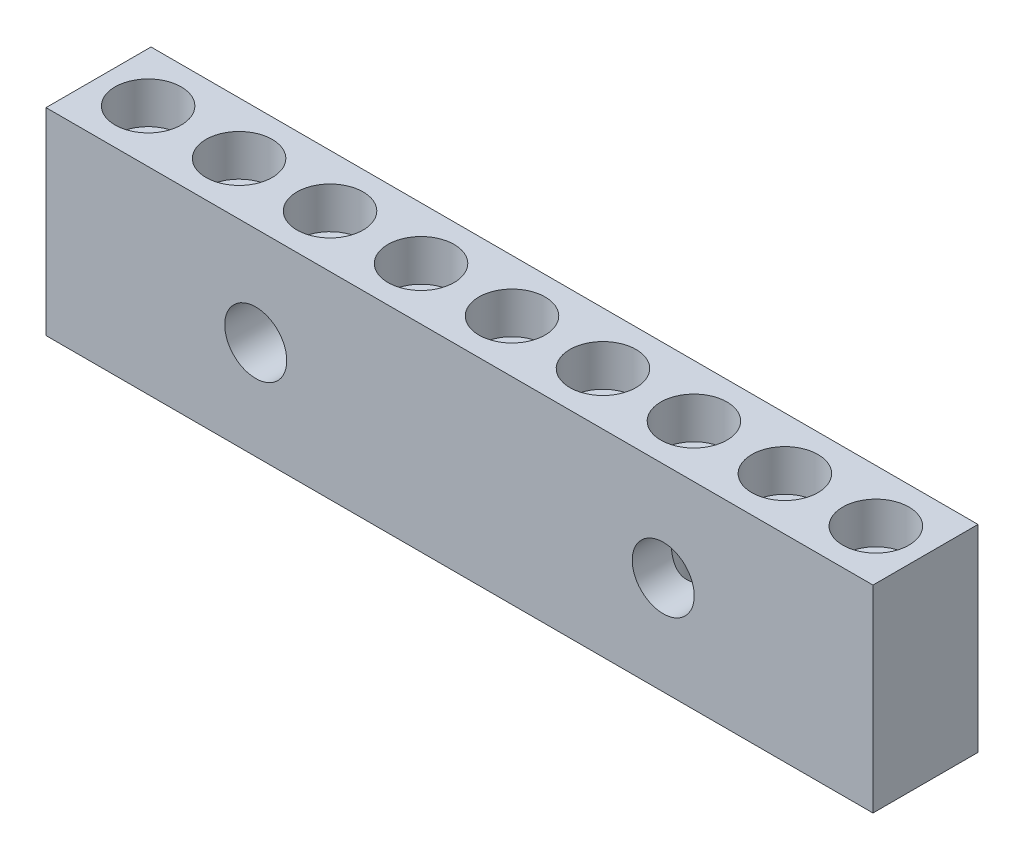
from build123d import *

# Parameters (mm, degrees)
SKETCH1_W           = 200
SKETCH1_H           = 47.75
BOSS_EXTRUDE1_DEPTH = 12.7
SKETCH3_R           = 7.5
CUT_EXTRUDE1_DEPTH  = 25.4
SKETCH6_R           = 8
CUT_EXTRUDE4_DEPTH  = 10
SKETCH7_R           = 4
CUT_EXTRUDE5_DEPTH  = 37.75
LPATTERN1_COUNT     = 9
LPATTERN1_PITCH     = 22


with BuildPart() as part:
    # Sketch1 → Boss-Extrude1 (new, symmetric)
    with BuildSketch(Plane.XY):
        Rectangle(SKETCH1_W, SKETCH1_H)
    extrude(amount=BOSS_EXTRUDE1_DEPTH, both=True)

    # Sketch3 → Cut-Extrude1 (cut)
    with BuildSketch(Plane.XY.offset(12.7)):
        with Locations((-49.275, -0.005)):
            Circle(SKETCH3_R)
        with Locations((49.275, -0.005)):
            Circle(SKETCH3_R)
    extrude(amount=-CUT_EXTRUDE1_DEPTH, mode=Mode.SUBTRACT)

    # Sketch6 → Cut-Extrude4 (cut)
    with BuildSketch(Plane(origin=(0, 23.875, 0), x_dir=(1, 0, 0), z_dir=(0, 1, 0))):
        with Locations(Location((-88, 0, 0), (0, 0, 180))):
            Circle(SKETCH6_R)
    cut_extrude4 = extrude(amount=-CUT_EXTRUDE4_DEPTH, mode=Mode.SUBTRACT)

    # Sketch7 → Cut-Extrude5 (cut)
    with BuildSketch(Plane(origin=(0, 13.875, 0), x_dir=(1, 0, 0), z_dir=(0, 1, 0))):
        with Locations(Location((-88, 0, 0), (0, 0, 180))):
            Circle(SKETCH7_R)
    cut_extrude5 = extrude(amount=-CUT_EXTRUDE5_DEPTH, mode=Mode.SUBTRACT)

    # LPattern1: Cut-Extrude4, Cut-Extrude5 ×9
    with Locations(*[(i * LPATTERN1_PITCH, 0, 0) for i in range(1, LPATTERN1_COUNT)]):
        add(cut_extrude4, mode=Mode.SUBTRACT)
        add(cut_extrude5, mode=Mode.SUBTRACT)


solid = part.part
